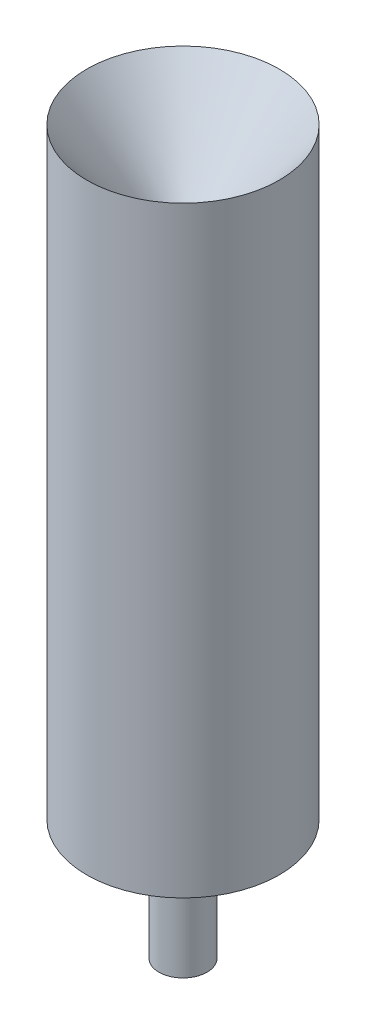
ISO-10303-21;
HEADER;
FILE_DESCRIPTION(('STEP AP214'),'2;1');
FILE_NAME('part.step','',(''),(''),'','','');
FILE_SCHEMA(('AUTOMOTIVE_DESIGN { 1 0 10303 214 1 1 1 1 }'));
ENDSEC;
DATA;
#1=APPLICATION_CONTEXT('core data for automotive mechanical design processes');
#2=APPLICATION_PROTOCOL_DEFINITION('international standard','automotive_design',2000,#1);
#3=PRODUCT_CONTEXT('',#1,'mechanical');
#4=PRODUCT('Part','Part','',(#3));
#5=PRODUCT_RELATED_PRODUCT_CATEGORY('part','',(#4));
#6=PRODUCT_DEFINITION_FORMATION('','',#4);
#7=PRODUCT_DEFINITION_CONTEXT('part definition',#1,'design');
#8=PRODUCT_DEFINITION('design','',#6,#7);
#9=PRODUCT_DEFINITION_SHAPE('','',#8);
#10=(LENGTH_UNIT() NAMED_UNIT(*) SI_UNIT(.MILLI.,.METRE.));
#11=(NAMED_UNIT(*) PLANE_ANGLE_UNIT() SI_UNIT($,.RADIAN.));
#12=(NAMED_UNIT(*) SI_UNIT($,.STERADIAN.) SOLID_ANGLE_UNIT());
#13=UNCERTAINTY_MEASURE_WITH_UNIT(LENGTH_MEASURE(1.E-05),#10,'distance_accuracy_value','');
#14=(GEOMETRIC_REPRESENTATION_CONTEXT(3) GLOBAL_UNCERTAINTY_ASSIGNED_CONTEXT((#13)) GLOBAL_UNIT_ASSIGNED_CONTEXT((#10,
#11,#12)) REPRESENTATION_CONTEXT('',''));
#15=CARTESIAN_POINT('',(0.,0.,0.));
#16=DIRECTION('',(0.,0.,1.));
#17=DIRECTION('',(1.,0.,0.));
#18=AXIS2_PLACEMENT_3D('',#15,#16,#17);
#19=CARTESIAN_POINT('',(0.,60.,0.));
#20=DIRECTION('',(0.,1.,0.));
#21=DIRECTION('',(-1.,0.,0.));
#22=AXIS2_PLACEMENT_3D('',#19,#20,#21);
#23=CONICAL_SURFACE('',#22,8.00000000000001,0.674740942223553);
#24=CARTESIAN_POINT('',(0.,50.,0.));
#25=VERTEX_POINT('',#24);
#26=VERTEX_LOOP('',#25);
#27=FACE_BOUND('',#26,.T.);
#28=CARTESIAN_POINT('',(0.,60.,0.));
#29=DIRECTION('',(0.,1.,0.));
#30=DIRECTION('',(-1.,0.,0.));
#31=AXIS2_PLACEMENT_3D('',#28,#29,#30);
#32=CIRCLE('',#31,8.00000000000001);
#33=CARTESIAN_POINT('',(-8.00000000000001,60.,0.));
#34=VERTEX_POINT('',#33);
#35=EDGE_CURVE('E11',#34,#34,#32,.T.);
#36=ORIENTED_EDGE('',*,*,#35,.T.);
#37=EDGE_LOOP('',(#36));
#38=FACE_BOUND('',#37,.T.);
#39=ADVANCED_FACE('F41',(#27,#38),#23,.F.);
#40=CARTESIAN_POINT('',(0.,50.,0.));
#41=DIRECTION('',(0.,1.,0.));
#42=DIRECTION('',(-1.,0.,0.));
#43=AXIS2_PLACEMENT_3D('',#40,#41,#42);
#44=CYLINDRICAL_SURFACE('',#43,8.);
#45=ORIENTED_EDGE('',*,*,#35,.F.);
#46=EDGE_LOOP('',(#45));
#47=FACE_BOUND('',#46,.T.);
#48=CARTESIAN_POINT('',(0.,10.,0.));
#49=DIRECTION('',(0.,1.,0.));
#50=DIRECTION('',(-1.,0.,0.));
#51=AXIS2_PLACEMENT_3D('',#48,#49,#50);
#52=CIRCLE('',#51,8.);
#53=CARTESIAN_POINT('',(-8.,10.,0.));
#54=VERTEX_POINT('',#53);
#55=EDGE_CURVE('E48',#54,#54,#52,.T.);
#56=ORIENTED_EDGE('',*,*,#55,.T.);
#57=EDGE_LOOP('',(#56));
#58=FACE_BOUND('',#57,.T.);
#59=ADVANCED_FACE('F53',(#47,#58),#44,.T.);
#60=CARTESIAN_POINT('',(2.,10.,0.));
#61=DIRECTION('',(0.,1.,0.));
#62=DIRECTION('',(-1.,0.,0.));
#63=AXIS2_PLACEMENT_3D('',#60,#61,#62);
#64=PLANE('',#63);
#65=ORIENTED_EDGE('',*,*,#55,.F.);
#66=EDGE_LOOP('',(#65));
#67=FACE_BOUND('',#66,.T.);
#68=CARTESIAN_POINT('',(0.,10.,0.));
#69=DIRECTION('',(0.,1.,0.));
#70=DIRECTION('',(-1.,0.,0.));
#71=AXIS2_PLACEMENT_3D('',#68,#69,#70);
#72=CIRCLE('',#71,2.);
#73=CARTESIAN_POINT('',(-2.,10.,0.));
#74=VERTEX_POINT('',#73);
#75=EDGE_CURVE('E63',#74,#74,#72,.T.);
#76=ORIENTED_EDGE('',*,*,#75,.T.);
#77=EDGE_LOOP('',(#76));
#78=FACE_BOUND('',#77,.T.);
#79=ADVANCED_FACE('F58',(#67,#78),#64,.F.);
#80=CARTESIAN_POINT('',(0.,50.,0.));
#81=DIRECTION('',(0.,1.,0.));
#82=DIRECTION('',(-1.,0.,0.));
#83=AXIS2_PLACEMENT_3D('',#80,#81,#82);
#84=CYLINDRICAL_SURFACE('',#83,2.);
#85=ORIENTED_EDGE('',*,*,#75,.F.);
#86=EDGE_LOOP('',(#85));
#87=FACE_BOUND('',#86,.T.);
#88=CARTESIAN_POINT('',(0.,0.,0.));
#89=DIRECTION('',(0.,1.,0.));
#90=DIRECTION('',(-1.,0.,0.));
#91=AXIS2_PLACEMENT_3D('',#88,#89,#90);
#92=CIRCLE('',#91,2.);
#93=CARTESIAN_POINT('',(-2.,0.,0.));
#94=VERTEX_POINT('',#93);
#95=EDGE_CURVE('E66',#94,#94,#92,.T.);
#96=ORIENTED_EDGE('',*,*,#95,.T.);
#97=EDGE_LOOP('',(#96));
#98=FACE_BOUND('',#97,.T.);
#99=ADVANCED_FACE('F73',(#87,#98),#84,.T.);
#100=CARTESIAN_POINT('',(0.,0.,0.));
#101=DIRECTION('',(0.,1.,0.));
#102=DIRECTION('',(-1.,0.,0.));
#103=AXIS2_PLACEMENT_3D('',#100,#101,#102);
#104=PLANE('',#103);
#105=ORIENTED_EDGE('',*,*,#95,.F.);
#106=EDGE_LOOP('',(#105));
#107=FACE_BOUND('',#106,.T.);
#108=ADVANCED_FACE('F75',(#107),#104,.F.);
#109=CLOSED_SHELL('',(#39,#59,#79,#99,#108));
#110=MANIFOLD_SOLID_BREP('B2',#109);
#111=ADVANCED_BREP_SHAPE_REPRESENTATION('',(#18,#110),#14);
#112=SHAPE_DEFINITION_REPRESENTATION(#9,#111);
ENDSEC;
END-ISO-10303-21;
